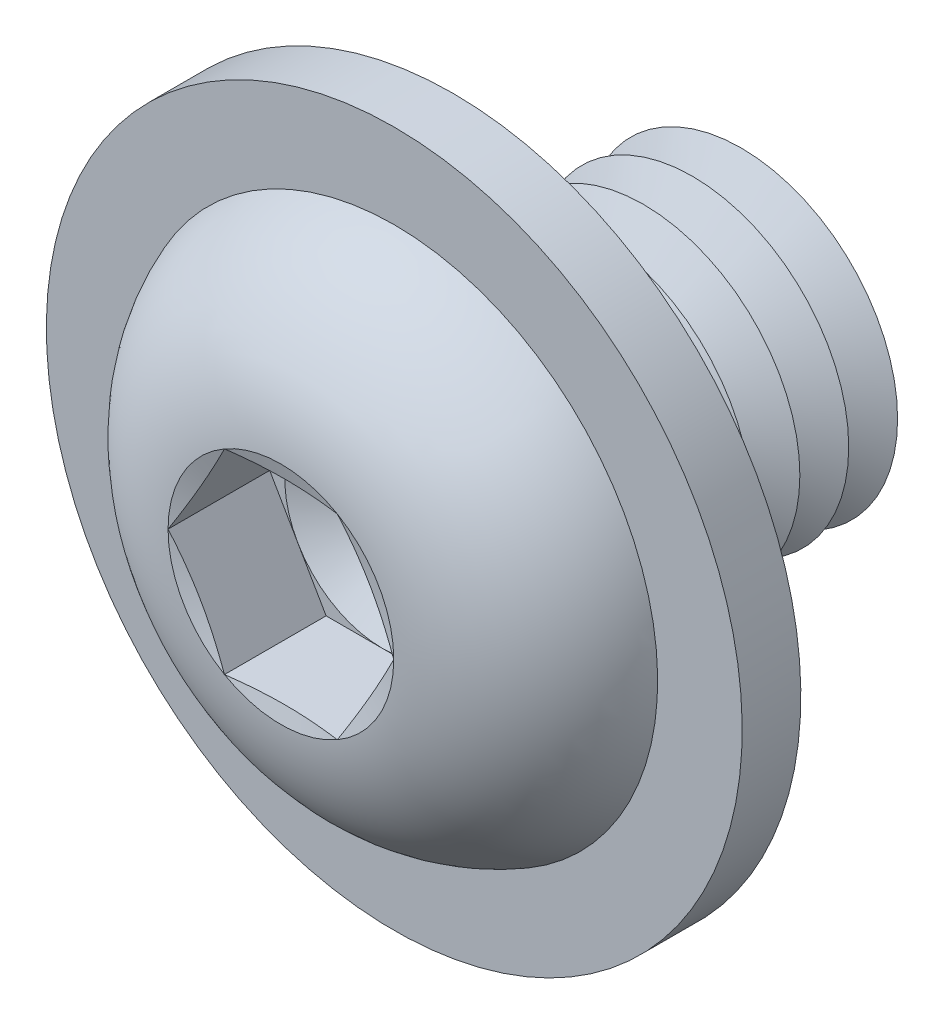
ISO-10303-21;
HEADER;
FILE_DESCRIPTION(('STEP AP214'),'2;1');
FILE_NAME('part.step','',(''),(''),'','','');
FILE_SCHEMA(('AUTOMOTIVE_DESIGN { 1 0 10303 214 1 1 1 1 }'));
ENDSEC;
DATA;
#1=APPLICATION_CONTEXT('core data for automotive mechanical design processes');
#2=APPLICATION_PROTOCOL_DEFINITION('international standard','automotive_design',2000,#1);
#3=PRODUCT_CONTEXT('',#1,'mechanical');
#4=PRODUCT('Part','Part','',(#3));
#5=PRODUCT_RELATED_PRODUCT_CATEGORY('part','',(#4));
#6=PRODUCT_DEFINITION_FORMATION('','',#4);
#7=PRODUCT_DEFINITION_CONTEXT('part definition',#1,'design');
#8=PRODUCT_DEFINITION('design','',#6,#7);
#9=PRODUCT_DEFINITION_SHAPE('','',#8);
#10=(LENGTH_UNIT() NAMED_UNIT(*) SI_UNIT(.MILLI.,.METRE.));
#11=(NAMED_UNIT(*) PLANE_ANGLE_UNIT() SI_UNIT($,.RADIAN.));
#12=(NAMED_UNIT(*) SI_UNIT($,.STERADIAN.) SOLID_ANGLE_UNIT());
#13=UNCERTAINTY_MEASURE_WITH_UNIT(LENGTH_MEASURE(1.E-05),#10,'distance_accuracy_value','');
#14=(GEOMETRIC_REPRESENTATION_CONTEXT(3) GLOBAL_UNCERTAINTY_ASSIGNED_CONTEXT((#13)) GLOBAL_UNIT_ASSIGNED_CONTEXT((#10,
#11,#12)) REPRESENTATION_CONTEXT('',''));
#15=CARTESIAN_POINT('',(0.,0.,0.));
#16=DIRECTION('',(0.,0.,1.));
#17=DIRECTION('',(1.,0.,0.));
#18=AXIS2_PLACEMENT_3D('',#15,#16,#17);
#19=CARTESIAN_POINT('',(0.,0.,-3.62500000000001));
#20=DIRECTION('',(0.,0.,1.));
#21=DIRECTION('',(0.,-1.,0.));
#22=AXIS2_PLACEMENT_3D('',#19,#20,#21);
#23=CONICAL_SURFACE('',#22,3.99999999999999,1.0471975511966);
#24=CARTESIAN_POINT('',(0.,0.,-4.25000000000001));
#25=DIRECTION('',(0.,0.,1.));
#26=DIRECTION('',(0.,-1.,0.));
#27=AXIS2_PLACEMENT_3D('',#24,#25,#26);
#28=CIRCLE('',#27,2.91746824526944);
#29=CARTESIAN_POINT('',(0.,-2.91746824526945,-4.25000000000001));
#30=VERTEX_POINT('',#29);
#31=EDGE_CURVE('E258',#30,#30,#28,.T.);
#32=ORIENTED_EDGE('',*,*,#31,.T.);
#33=EDGE_LOOP('',(#32));
#34=FACE_BOUND('',#33,.T.);
#35=CARTESIAN_POINT('',(0.,0.,-3.62500000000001));
#36=DIRECTION('',(0.,0.,1.));
#37=DIRECTION('',(0.,-1.,0.));
#38=AXIS2_PLACEMENT_3D('',#35,#36,#37);
#39=CIRCLE('',#38,3.99999999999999);
#40=CARTESIAN_POINT('',(0.,-4.,-3.62500000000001));
#41=VERTEX_POINT('',#40);
#42=EDGE_CURVE('E254',#41,#41,#39,.T.);
#43=ORIENTED_EDGE('',*,*,#42,.F.);
#44=EDGE_LOOP('',(#43));
#45=FACE_BOUND('',#44,.T.);
#46=ADVANCED_FACE('F39',(#34,#45),#23,.T.);
#47=CARTESIAN_POINT('',(0.,0.,-4.25000000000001));
#48=DIRECTION('',(0.,0.,-1.));
#49=DIRECTION('',(0.,1.,0.));
#50=AXIS2_PLACEMENT_3D('',#47,#48,#49);
#51=CONICAL_SURFACE('',#50,2.91746824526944,1.0471975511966);
#52=CARTESIAN_POINT('',(0.,0.,-4.87500000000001));
#53=DIRECTION('',(0.,0.,1.));
#54=DIRECTION('',(0.,-1.,0.));
#55=AXIS2_PLACEMENT_3D('',#52,#53,#54);
#56=CIRCLE('',#55,3.99999999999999);
#57=CARTESIAN_POINT('',(0.,-4.,-4.87500000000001));
#58=VERTEX_POINT('',#57);
#59=EDGE_CURVE('E262',#58,#58,#56,.T.);
#60=ORIENTED_EDGE('',*,*,#59,.T.);
#61=EDGE_LOOP('',(#60));
#62=FACE_BOUND('',#61,.T.);
#63=ORIENTED_EDGE('',*,*,#31,.F.);
#64=EDGE_LOOP('',(#63));
#65=FACE_BOUND('',#64,.T.);
#66=ADVANCED_FACE('F383',(#62,#65),#51,.T.);
#67=CARTESIAN_POINT('',(0.,3.99999999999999,-8.00000000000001));
#68=DIRECTION('',(0.,0.,-1.));
#69=DIRECTION('',(0.,1.,0.));
#70=AXIS2_PLACEMENT_3D('',#67,#68,#69);
#71=PLANE('',#70);
#72=CARTESIAN_POINT('',(0.,0.,-8.00000000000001));
#73=DIRECTION('',(0.,0.,1.));
#74=DIRECTION('',(0.,-1.,0.));
#75=AXIS2_PLACEMENT_3D('',#72,#73,#74);
#76=CIRCLE('',#75,2.91746824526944);
#77=CARTESIAN_POINT('',(0.,-2.91746824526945,-8.00000000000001));
#78=VERTEX_POINT('',#77);
#79=EDGE_CURVE('E282',#78,#78,#76,.T.);
#80=ORIENTED_EDGE('',*,*,#79,.F.);
#81=EDGE_LOOP('',(#80));
#82=FACE_BOUND('',#81,.T.);
#83=ADVANCED_FACE('F389',(#82),#71,.T.);
#84=CARTESIAN_POINT('',(0.,0.,-7.37500000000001));
#85=DIRECTION('',(0.,0.,1.));
#86=DIRECTION('',(0.,-1.,0.));
#87=AXIS2_PLACEMENT_3D('',#84,#85,#86);
#88=CONICAL_SURFACE('',#87,3.99999999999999,1.0471975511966);
#89=ORIENTED_EDGE('',*,*,#79,.T.);
#90=EDGE_LOOP('',(#89));
#91=FACE_BOUND('',#90,.T.);
#92=CARTESIAN_POINT('',(0.,0.,-7.37500000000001));
#93=DIRECTION('',(0.,0.,1.));
#94=DIRECTION('',(0.,-1.,0.));
#95=AXIS2_PLACEMENT_3D('',#92,#93,#94);
#96=CIRCLE('',#95,3.99999999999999);
#97=CARTESIAN_POINT('',(0.,-4.,-7.37500000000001));
#98=VERTEX_POINT('',#97);
#99=EDGE_CURVE('E278',#98,#98,#96,.T.);
#100=ORIENTED_EDGE('',*,*,#99,.F.);
#101=EDGE_LOOP('',(#100));
#102=FACE_BOUND('',#101,.T.);
#103=ADVANCED_FACE('F408',(#91,#102),#88,.T.);
#104=CARTESIAN_POINT('',(0.,0.,-6.75000000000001));
#105=DIRECTION('',(0.,0.,-1.));
#106=DIRECTION('',(0.,1.,0.));
#107=AXIS2_PLACEMENT_3D('',#104,#105,#106);
#108=CONICAL_SURFACE('',#107,2.91746824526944,1.0471975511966);
#109=ORIENTED_EDGE('',*,*,#99,.T.);
#110=EDGE_LOOP('',(#109));
#111=FACE_BOUND('',#110,.T.);
#112=CARTESIAN_POINT('',(0.,0.,-6.75000000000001));
#113=DIRECTION('',(0.,0.,1.));
#114=DIRECTION('',(0.,-1.,0.));
#115=AXIS2_PLACEMENT_3D('',#112,#113,#114);
#116=CIRCLE('',#115,2.91746824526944);
#117=CARTESIAN_POINT('',(0.,-2.91746824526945,-6.75000000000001));
#118=VERTEX_POINT('',#117);
#119=EDGE_CURVE('E274',#118,#118,#116,.T.);
#120=ORIENTED_EDGE('',*,*,#119,.F.);
#121=EDGE_LOOP('',(#120));
#122=FACE_BOUND('',#121,.T.);
#123=ADVANCED_FACE('F405',(#111,#122),#108,.T.);
#124=CARTESIAN_POINT('',(0.,0.,-6.12500000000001));
#125=DIRECTION('',(0.,0.,1.));
#126=DIRECTION('',(0.,-1.,0.));
#127=AXIS2_PLACEMENT_3D('',#124,#125,#126);
#128=CONICAL_SURFACE('',#127,3.99999999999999,1.0471975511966);
#129=ORIENTED_EDGE('',*,*,#119,.T.);
#130=EDGE_LOOP('',(#129));
#131=FACE_BOUND('',#130,.T.);
#132=CARTESIAN_POINT('',(0.,0.,-6.12500000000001));
#133=DIRECTION('',(0.,0.,1.));
#134=DIRECTION('',(0.,-1.,0.));
#135=AXIS2_PLACEMENT_3D('',#132,#133,#134);
#136=CIRCLE('',#135,3.99999999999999);
#137=CARTESIAN_POINT('',(0.,-4.,-6.12500000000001));
#138=VERTEX_POINT('',#137);
#139=EDGE_CURVE('E270',#138,#138,#136,.T.);
#140=ORIENTED_EDGE('',*,*,#139,.F.);
#141=EDGE_LOOP('',(#140));
#142=FACE_BOUND('',#141,.T.);
#143=ADVANCED_FACE('F399',(#131,#142),#128,.T.);
#144=CARTESIAN_POINT('',(0.,0.,-5.50000000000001));
#145=DIRECTION('',(0.,0.,-1.));
#146=DIRECTION('',(0.,1.,0.));
#147=AXIS2_PLACEMENT_3D('',#144,#145,#146);
#148=CONICAL_SURFACE('',#147,2.91746824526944,1.0471975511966);
#149=ORIENTED_EDGE('',*,*,#139,.T.);
#150=EDGE_LOOP('',(#149));
#151=FACE_BOUND('',#150,.T.);
#152=CARTESIAN_POINT('',(0.,0.,-5.50000000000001));
#153=DIRECTION('',(0.,0.,1.));
#154=DIRECTION('',(0.,-1.,0.));
#155=AXIS2_PLACEMENT_3D('',#152,#153,#154);
#156=CIRCLE('',#155,2.91746824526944);
#157=CARTESIAN_POINT('',(0.,-2.91746824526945,-5.50000000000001));
#158=VERTEX_POINT('',#157);
#159=EDGE_CURVE('E266',#158,#158,#156,.T.);
#160=ORIENTED_EDGE('',*,*,#159,.F.);
#161=EDGE_LOOP('',(#160));
#162=FACE_BOUND('',#161,.T.);
#163=ADVANCED_FACE('F395',(#151,#162),#148,.T.);
#164=CARTESIAN_POINT('',(0.,0.,-4.87500000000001));
#165=DIRECTION('',(0.,0.,1.));
#166=DIRECTION('',(0.,-1.,0.));
#167=AXIS2_PLACEMENT_3D('',#164,#165,#166);
#168=CONICAL_SURFACE('',#167,3.99999999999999,1.0471975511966);
#169=ORIENTED_EDGE('',*,*,#159,.T.);
#170=EDGE_LOOP('',(#169));
#171=FACE_BOUND('',#170,.T.);
#172=ORIENTED_EDGE('',*,*,#59,.F.);
#173=EDGE_LOOP('',(#172));
#174=FACE_BOUND('',#173,.T.);
#175=ADVANCED_FACE('F398',(#171,#174),#168,.T.);
#176=CARTESIAN_POINT('',(0.,0.,-2.37500000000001));
#177=DIRECTION('',(0.,0.,1.));
#178=DIRECTION('',(0.,-1.,0.));
#179=AXIS2_PLACEMENT_3D('',#176,#177,#178);
#180=CONICAL_SURFACE('',#179,3.99999999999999,1.0471975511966);
#181=CARTESIAN_POINT('',(0.,0.,-3.00000000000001));
#182=DIRECTION('',(0.,0.,1.));
#183=DIRECTION('',(0.,-1.,0.));
#184=AXIS2_PLACEMENT_3D('',#181,#182,#183);
#185=CIRCLE('',#184,2.91746824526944);
#186=CARTESIAN_POINT('',(0.,-2.91746824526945,-3.00000000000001));
#187=VERTEX_POINT('',#186);
#188=EDGE_CURVE('E250',#187,#187,#185,.T.);
#189=ORIENTED_EDGE('',*,*,#188,.T.);
#190=EDGE_LOOP('',(#189));
#191=FACE_BOUND('',#190,.T.);
#192=CARTESIAN_POINT('',(0.,0.,-2.37500000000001));
#193=DIRECTION('',(0.,0.,1.));
#194=DIRECTION('',(0.,-1.,0.));
#195=AXIS2_PLACEMENT_3D('',#192,#193,#194);
#196=CIRCLE('',#195,3.99999999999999);
#197=CARTESIAN_POINT('',(0.,-4.,-2.37500000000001));
#198=VERTEX_POINT('',#197);
#199=EDGE_CURVE('E242',#198,#198,#196,.T.);
#200=ORIENTED_EDGE('',*,*,#199,.F.);
#201=EDGE_LOOP('',(#200));
#202=FACE_BOUND('',#201,.T.);
#203=ADVANCED_FACE('F403',(#191,#202),#180,.T.);
#204=CARTESIAN_POINT('',(0.,0.,-3.00000000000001));
#205=DIRECTION('',(0.,0.,-1.));
#206=DIRECTION('',(0.,1.,0.));
#207=AXIS2_PLACEMENT_3D('',#204,#205,#206);
#208=CONICAL_SURFACE('',#207,2.91746824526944,1.0471975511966);
#209=ORIENTED_EDGE('',*,*,#42,.T.);
#210=EDGE_LOOP('',(#209));
#211=FACE_BOUND('',#210,.T.);
#212=ORIENTED_EDGE('',*,*,#188,.F.);
#213=EDGE_LOOP('',(#212));
#214=FACE_BOUND('',#213,.T.);
#215=ADVANCED_FACE('F454',(#211,#214),#208,.T.);
#216=CARTESIAN_POINT('',(0.,0.,-1.12500000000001));
#217=DIRECTION('',(0.,0.,1.));
#218=DIRECTION('',(0.,-1.,0.));
#219=AXIS2_PLACEMENT_3D('',#216,#217,#218);
#220=CONICAL_SURFACE('',#219,3.99999999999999,1.0471975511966);
#221=CARTESIAN_POINT('',(0.,0.,-1.75000000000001));
#222=DIRECTION('',(0.,0.,1.));
#223=DIRECTION('',(0.,-1.,0.));
#224=AXIS2_PLACEMENT_3D('',#221,#222,#223);
#225=CIRCLE('',#224,2.91746824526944);
#226=CARTESIAN_POINT('',(0.,-2.91746824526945,-1.75000000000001));
#227=VERTEX_POINT('',#226);
#228=EDGE_CURVE('E231',#227,#227,#225,.T.);
#229=ORIENTED_EDGE('',*,*,#228,.T.);
#230=EDGE_LOOP('',(#229));
#231=FACE_BOUND('',#230,.T.);
#232=CARTESIAN_POINT('',(0.,0.,-1.12500000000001));
#233=DIRECTION('',(0.,0.,1.));
#234=DIRECTION('',(0.,-1.,0.));
#235=AXIS2_PLACEMENT_3D('',#232,#233,#234);
#236=CIRCLE('',#235,3.99999999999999);
#237=CARTESIAN_POINT('',(0.,-4.,-1.12500000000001));
#238=VERTEX_POINT('',#237);
#239=EDGE_CURVE('E246',#238,#238,#236,.T.);
#240=ORIENTED_EDGE('',*,*,#239,.F.);
#241=EDGE_LOOP('',(#240));
#242=FACE_BOUND('',#241,.T.);
#243=ADVANCED_FACE('F460',(#231,#242),#220,.T.);
#244=CARTESIAN_POINT('',(0.,0.,-1.75000000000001));
#245=DIRECTION('',(0.,0.,-1.));
#246=DIRECTION('',(0.,1.,0.));
#247=AXIS2_PLACEMENT_3D('',#244,#245,#246);
#248=CONICAL_SURFACE('',#247,2.91746824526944,1.0471975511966);
#249=ORIENTED_EDGE('',*,*,#199,.T.);
#250=EDGE_LOOP('',(#249));
#251=FACE_BOUND('',#250,.T.);
#252=ORIENTED_EDGE('',*,*,#228,.F.);
#253=EDGE_LOOP('',(#252));
#254=FACE_BOUND('',#253,.T.);
#255=ADVANCED_FACE('F220',(#251,#254),#248,.T.);
#256=CARTESIAN_POINT('',(0.,3.99999999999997,0.));
#257=DIRECTION('',(0.,0.,-1.));
#258=DIRECTION('',(0.,1.,0.));
#259=AXIS2_PLACEMENT_3D('',#256,#257,#258);
#260=PLANE('',#259);
#261=CARTESIAN_POINT('',(0.,0.,0.));
#262=DIRECTION('',(0.,0.,-1.));
#263=DIRECTION('',(0.,1.,0.));
#264=AXIS2_PLACEMENT_3D('',#261,#262,#263);
#265=CIRCLE('',#264,4.62499999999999);
#266=CARTESIAN_POINT('',(0.,4.62499999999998,0.));
#267=VERTEX_POINT('',#266);
#268=EDGE_CURVE('E296',#267,#267,#265,.F.);
#269=ORIENTED_EDGE('',*,*,#268,.T.);
#270=EDGE_LOOP('',(#269));
#271=FACE_BOUND('',#270,.T.);
#272=CARTESIAN_POINT('',(0.,0.,0.));
#273=DIRECTION('',(0.,0.,-1.));
#274=DIRECTION('',(0.,1.,0.));
#275=AXIS2_PLACEMENT_3D('',#272,#273,#274);
#276=CIRCLE('',#275,8.9);
#277=CARTESIAN_POINT('',(0.,8.9,0.));
#278=VERTEX_POINT('',#277);
#279=EDGE_CURVE('E747',#278,#278,#276,.T.);
#280=ORIENTED_EDGE('',*,*,#279,.T.);
#281=EDGE_LOOP('',(#280));
#282=FACE_BOUND('',#281,.T.);
#283=ADVANCED_FACE('F472',(#271,#282),#260,.T.);
#284=CARTESIAN_POINT('',(0.,0.,-0.625000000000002));
#285=DIRECTION('',(0.,0.,-1.));
#286=DIRECTION('',(0.,1.,0.));
#287=AXIS2_PLACEMENT_3D('',#284,#285,#286);
#288=TOROIDAL_SURFACE('',#287,4.62499999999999,0.625);
#289=ORIENTED_EDGE('',*,*,#268,.F.);
#290=EDGE_LOOP('',(#289));
#291=FACE_BOUND('',#290,.T.);
#292=CARTESIAN_POINT('',(0.,0.,-0.625000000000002));
#293=DIRECTION('',(0.,0.,-1.));
#294=DIRECTION('',(0.,1.,0.));
#295=AXIS2_PLACEMENT_3D('',#292,#293,#294);
#296=CIRCLE('',#295,3.99999999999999);
#297=CARTESIAN_POINT('',(0.,3.99999999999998,-0.625));
#298=VERTEX_POINT('',#297);
#299=EDGE_CURVE('E291',#298,#298,#296,.T.);
#300=ORIENTED_EDGE('',*,*,#299,.F.);
#301=EDGE_LOOP('',(#300));
#302=FACE_BOUND('',#301,.T.);
#303=ADVANCED_FACE('F41',(#291,#302),#288,.F.);
#304=CARTESIAN_POINT('',(0.,0.,-8.00000000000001));
#305=DIRECTION('',(0.,0.,-1.));
#306=DIRECTION('',(0.,1.,0.));
#307=AXIS2_PLACEMENT_3D('',#304,#305,#306);
#308=CYLINDRICAL_SURFACE('',#307,3.99999999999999);
#309=ORIENTED_EDGE('',*,*,#299,.T.);
#310=EDGE_LOOP('',(#309));
#311=FACE_BOUND('',#310,.T.);
#312=ORIENTED_EDGE('',*,*,#239,.T.);
#313=EDGE_LOOP('',(#312));
#314=FACE_BOUND('',#313,.T.);
#315=ADVANCED_FACE('F484',(#311,#314),#308,.T.);
#316=CARTESIAN_POINT('',(0.,0.,1.5));
#317=DIRECTION('',(0.,0.,-1.));
#318=DIRECTION('',(0.,1.,0.));
#319=AXIS2_PLACEMENT_3D('',#316,#317,#318);
#320=CYLINDRICAL_SURFACE('',#319,8.9);
#321=CARTESIAN_POINT('',(0.,0.,1.5));
#322=DIRECTION('',(0.,0.,-1.));
#323=DIRECTION('',(0.,1.,0.));
#324=AXIS2_PLACEMENT_3D('',#321,#322,#323);
#325=CIRCLE('',#324,8.9);
#326=CARTESIAN_POINT('',(0.,8.9,1.5));
#327=VERTEX_POINT('',#326);
#328=EDGE_CURVE('E749',#327,#327,#325,.T.);
#329=ORIENTED_EDGE('',*,*,#328,.T.);
#330=EDGE_LOOP('',(#329));
#331=FACE_BOUND('',#330,.T.);
#332=ORIENTED_EDGE('',*,*,#279,.F.);
#333=EDGE_LOOP('',(#332));
#334=FACE_BOUND('',#333,.T.);
#335=ADVANCED_FACE('F490',(#331,#334),#320,.T.);
#336=CARTESIAN_POINT('',(0.,0.,1.5));
#337=DIRECTION('',(0.,0.,-1.));
#338=DIRECTION('',(0.,1.,0.));
#339=AXIS2_PLACEMENT_3D('',#336,#337,#338);
#340=PLANE('',#339);
#341=CARTESIAN_POINT('',(0.,0.,1.5));
#342=DIRECTION('',(0.,0.,-1.));
#343=DIRECTION('',(0.,1.,0.));
#344=AXIS2_PLACEMENT_3D('',#341,#342,#343);
#345=CIRCLE('',#344,6.73705889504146);
#346=CARTESIAN_POINT('',(0.,6.73705889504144,1.5));
#347=VERTEX_POINT('',#346);
#348=EDGE_CURVE('E43',#347,#347,#345,.F.);
#349=ORIENTED_EDGE('',*,*,#348,.F.);
#350=EDGE_LOOP('',(#349));
#351=FACE_BOUND('',#350,.T.);
#352=ORIENTED_EDGE('',*,*,#328,.F.);
#353=EDGE_LOOP('',(#352));
#354=FACE_BOUND('',#353,.T.);
#355=ADVANCED_FACE('F117',(#351,#354),#340,.F.);
#356=CARTESIAN_POINT('',(0.,0.,1.8));
#357=DIRECTION('',(0.,0.,1.));
#358=DIRECTION('',(1.,0.,0.));
#359=AXIS2_PLACEMENT_3D('',#356,#357,#358);
#360=CONICAL_SURFACE('',#359,2.49999883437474,1.0471975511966);
#361=CARTESIAN_POINT('',(0.,0.,0.356625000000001));
#362=VERTEX_POINT('',#361);
#363=VERTEX_LOOP('',#362);
#364=FACE_BOUND('',#363,.T.);
#365=CARTESIAN_POINT('',(0.,0.,1.8));
#366=DIRECTION('',(0.,0.,1.));
#367=DIRECTION('',(1.,0.,0.));
#368=AXIS2_PLACEMENT_3D('',#365,#366,#367);
#369=CIRCLE('',#368,2.49999883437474);
#370=CARTESIAN_POINT('',(2.16506250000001,1.24999941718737,1.8));
#371=VERTEX_POINT('',#370);
#372=CARTESIAN_POINT('',(0.,2.49999883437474,1.8));
#373=VERTEX_POINT('',#372);
#374=EDGE_CURVE('E120',#371,#373,#369,.T.);
#375=ORIENTED_EDGE('',*,*,#374,.T.);
#376=CARTESIAN_POINT('',(0.,0.,1.8));
#377=DIRECTION('',(0.,0.,1.));
#378=DIRECTION('',(1.,0.,0.));
#379=AXIS2_PLACEMENT_3D('',#376,#377,#378);
#380=CIRCLE('',#379,2.49999883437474);
#381=CARTESIAN_POINT('',(-2.16506250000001,1.24999941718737,1.8));
#382=VERTEX_POINT('',#381);
#383=EDGE_CURVE('E11',#373,#382,#380,.T.);
#384=ORIENTED_EDGE('',*,*,#383,.T.);
#385=CARTESIAN_POINT('',(-2.16506250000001,-1.24999941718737,1.8));
#386=VERTEX_POINT('',#385);
#387=EDGE_CURVE('E49',#382,#386,#380,.T.);
#388=ORIENTED_EDGE('',*,*,#387,.T.);
#389=CARTESIAN_POINT('',(0.,-2.49999883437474,1.8));
#390=VERTEX_POINT('',#389);
#391=EDGE_CURVE('E302',#386,#390,#380,.T.);
#392=ORIENTED_EDGE('',*,*,#391,.T.);
#393=CARTESIAN_POINT('',(2.16506250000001,-1.24999941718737,1.8));
#394=VERTEX_POINT('',#393);
#395=EDGE_CURVE('E57',#390,#394,#380,.T.);
#396=ORIENTED_EDGE('',*,*,#395,.T.);
#397=EDGE_CURVE('E50',#394,#371,#380,.T.);
#398=ORIENTED_EDGE('',*,*,#397,.T.);
#399=EDGE_LOOP('',(#375,#384,#388,#392,#396,#398));
#400=FACE_BOUND('',#399,.T.);
#401=ADVANCED_FACE('F114',(#364,#400),#360,.F.);
#402=CARTESIAN_POINT('',(0.,0.,1.8));
#403=DIRECTION('',(0.,0.,1.));
#404=DIRECTION('',(1.,0.,0.));
#405=AXIS2_PLACEMENT_3D('',#402,#403,#404);
#406=PLANE('',#405);
#407=ORIENTED_EDGE('',*,*,#383,.F.);
#408=DIRECTION('',(-1.,0.,0.));
#409=VECTOR('',#408,1.);
#410=CARTESIAN_POINT('',(1.44337500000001,2.49999883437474,1.8));
#411=LINE('',#410,#409);
#412=CARTESIAN_POINT('',(-1.44337500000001,2.49999883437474,1.8));
#413=VERTEX_POINT('',#412);
#414=EDGE_CURVE('E132',#373,#413,#411,.T.);
#415=ORIENTED_EDGE('',*,*,#414,.T.);
#416=DIRECTION('',(-0.5,-0.866025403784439,0.));
#417=VECTOR('',#416,1.);
#418=CARTESIAN_POINT('',(-1.44337500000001,2.49999883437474,1.8));
#419=LINE('',#418,#417);
#420=EDGE_CURVE('E135',#413,#382,#419,.T.);
#421=ORIENTED_EDGE('',*,*,#420,.T.);
#422=EDGE_LOOP('',(#407,#415,#421));
#423=FACE_BOUND('',#422,.T.);
#424=ADVANCED_FACE('F116',(#423),#406,.T.);
#425=ORIENTED_EDGE('',*,*,#387,.F.);
#426=CARTESIAN_POINT('',(-2.88675000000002,0.,1.8));
#427=VERTEX_POINT('',#426);
#428=EDGE_CURVE('E145',#382,#427,#419,.T.);
#429=ORIENTED_EDGE('',*,*,#428,.T.);
#430=DIRECTION('',(0.5,-0.866025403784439,0.));
#431=VECTOR('',#430,1.);
#432=CARTESIAN_POINT('',(-2.88675000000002,0.,1.8));
#433=LINE('',#432,#431);
#434=EDGE_CURVE('E154',#427,#386,#433,.T.);
#435=ORIENTED_EDGE('',*,*,#434,.T.);
#436=EDGE_LOOP('',(#425,#429,#435));
#437=FACE_BOUND('',#436,.T.);
#438=ADVANCED_FACE('F318',(#437),#406,.T.);
#439=ORIENTED_EDGE('',*,*,#391,.F.);
#440=CARTESIAN_POINT('',(-1.44337500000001,-2.49999883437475,1.8));
#441=VERTEX_POINT('',#440);
#442=EDGE_CURVE('E153',#386,#441,#433,.T.);
#443=ORIENTED_EDGE('',*,*,#442,.T.);
#444=DIRECTION('',(1.,0.,0.));
#445=VECTOR('',#444,1.);
#446=CARTESIAN_POINT('',(-1.44337500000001,-2.49999883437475,1.8));
#447=LINE('',#446,#445);
#448=EDGE_CURVE('E159',#441,#390,#447,.T.);
#449=ORIENTED_EDGE('',*,*,#448,.T.);
#450=EDGE_LOOP('',(#439,#443,#449));
#451=FACE_BOUND('',#450,.T.);
#452=ADVANCED_FACE('F312',(#451),#406,.T.);
#453=ORIENTED_EDGE('',*,*,#395,.F.);
#454=CARTESIAN_POINT('',(1.44337500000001,-2.49999883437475,1.8));
#455=VERTEX_POINT('',#454);
#456=EDGE_CURVE('E158',#390,#455,#447,.T.);
#457=ORIENTED_EDGE('',*,*,#456,.T.);
#458=DIRECTION('',(0.5,0.866025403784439,0.));
#459=VECTOR('',#458,1.);
#460=CARTESIAN_POINT('',(1.44337500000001,-2.49999883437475,1.8));
#461=LINE('',#460,#459);
#462=EDGE_CURVE('E164',#455,#394,#461,.T.);
#463=ORIENTED_EDGE('',*,*,#462,.T.);
#464=EDGE_LOOP('',(#453,#457,#463));
#465=FACE_BOUND('',#464,.T.);
#466=ADVANCED_FACE('F519',(#465),#406,.T.);
#467=ORIENTED_EDGE('',*,*,#397,.F.);
#468=CARTESIAN_POINT('',(2.88675000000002,0.,1.8));
#469=VERTEX_POINT('',#468);
#470=EDGE_CURVE('E163',#394,#469,#461,.T.);
#471=ORIENTED_EDGE('',*,*,#470,.T.);
#472=DIRECTION('',(-0.5,0.866025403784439,0.));
#473=VECTOR('',#472,1.);
#474=CARTESIAN_POINT('',(2.88675000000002,0.,1.8));
#475=LINE('',#474,#473);
#476=EDGE_CURVE('E141',#469,#371,#475,.T.);
#477=ORIENTED_EDGE('',*,*,#476,.T.);
#478=EDGE_LOOP('',(#467,#471,#477));
#479=FACE_BOUND('',#478,.T.);
#480=ADVANCED_FACE('F524',(#479),#406,.T.);
#481=ORIENTED_EDGE('',*,*,#374,.F.);
#482=CARTESIAN_POINT('',(1.44337500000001,2.49999883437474,1.8));
#483=VERTEX_POINT('',#482);
#484=EDGE_CURVE('E127',#371,#483,#475,.T.);
#485=ORIENTED_EDGE('',*,*,#484,.T.);
#486=EDGE_CURVE('E137',#483,#373,#411,.T.);
#487=ORIENTED_EDGE('',*,*,#486,.T.);
#488=EDGE_LOOP('',(#481,#485,#487));
#489=FACE_BOUND('',#488,.T.);
#490=ADVANCED_FACE('F143',(#489),#406,.T.);
#491=CARTESIAN_POINT('',(1.44337500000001,2.49999883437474,1.8));
#492=DIRECTION('',(0.,1.,0.));
#493=DIRECTION('',(-1.,0.,0.));
#494=AXIS2_PLACEMENT_3D('',#491,#492,#493);
#495=PLANE('',#494);
#496=CARTESIAN_POINT('',(4.35611719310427,2.49999883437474,4.97227902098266));
#497=CARTESIAN_POINT('',(4.25066509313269,2.49999883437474,4.94777440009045));
#498=CARTESIAN_POINT('',(4.14516541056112,2.49999883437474,4.92347459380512));
#499=CARTESIAN_POINT('',(3.93405094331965,2.49999883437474,4.87537247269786));
#500=CARTESIAN_POINT('',(3.8284361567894,2.49999883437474,4.85157016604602));
#501=CARTESIAN_POINT('',(3.51135349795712,2.49999883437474,4.78103338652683));
#502=CARTESIAN_POINT('',(3.29968815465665,2.49999883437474,4.73517861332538));
#503=CARTESIAN_POINT('',(2.8736552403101,2.49999883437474,4.64645582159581));
#504=CARTESIAN_POINT('',(2.65928093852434,2.49999883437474,4.60361983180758));
#505=CARTESIAN_POINT('',(2.22952626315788,2.49999883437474,4.52311285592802));
#506=CARTESIAN_POINT('',(2.01414580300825,2.49999883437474,4.48544232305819));
#507=CARTESIAN_POINT('',(1.58798319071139,2.49999883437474,4.41876559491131));
#508=CARTESIAN_POINT('',(1.37723418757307,2.49999883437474,4.38955265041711));
#509=CARTESIAN_POINT('',(0.954530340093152,2.49999883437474,4.34171384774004));
#510=CARTESIAN_POINT('',(0.742575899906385,2.49999883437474,4.32308463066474));
#511=CARTESIAN_POINT('',(0.424544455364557,2.49999883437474,4.3053914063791));
#512=CARTESIAN_POINT('',(0.318745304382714,2.49999883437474,4.30120018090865));
#513=CARTESIAN_POINT('',(0.107062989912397,2.49999883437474,4.29638997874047));
#514=CARTESIAN_POINT('',(0.00117982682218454,2.49999883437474,4.29577098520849));
#515=CARTESIAN_POINT('',(-0.210552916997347,2.49999883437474,4.29814378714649));
#516=CARTESIAN_POINT('',(-0.316402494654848,2.49999883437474,4.30113585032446));
#517=CARTESIAN_POINT('',(-0.527944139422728,2.49999883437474,4.31057322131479));
#518=CARTESIAN_POINT('',(-0.6336362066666,2.49999883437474,4.31701852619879));
#519=CARTESIAN_POINT('',(-0.890304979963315,2.49999883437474,4.33652018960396));
#520=CARTESIAN_POINT('',(-1.04115612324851,2.49999883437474,4.35122885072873));
#521=CARTESIAN_POINT('',(-1.34222474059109,2.49999883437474,4.38593609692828));
#522=CARTESIAN_POINT('',(-1.49244223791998,2.49999883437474,4.40593448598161));
#523=CARTESIAN_POINT('',(-1.79273634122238,2.49999883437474,4.45011321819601));
#524=CARTESIAN_POINT('',(-1.94281100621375,2.49999883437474,4.4743065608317));
#525=CARTESIAN_POINT('',(-2.24242097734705,2.49999883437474,4.52583552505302));
#526=CARTESIAN_POINT('',(-2.39195625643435,2.49999883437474,4.55317130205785));
#527=CARTESIAN_POINT('',(-2.69364402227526,2.49999883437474,4.61079781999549));
#528=CARTESIAN_POINT('',(-2.84578703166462,2.49999883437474,4.64113779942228));
#529=CARTESIAN_POINT('',(-3.1496901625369,2.49999883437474,4.70367638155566));
#530=CARTESIAN_POINT('',(-3.30145027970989,2.49999883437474,4.73587500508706));
#531=CARTESIAN_POINT('',(-3.60383766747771,2.49999883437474,4.80150275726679));
#532=CARTESIAN_POINT('',(-3.75446660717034,2.49999883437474,4.83492423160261));
#533=CARTESIAN_POINT('',(-4.05546753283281,2.49999883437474,4.90285814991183));
#534=CARTESIAN_POINT('',(-4.20583953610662,2.49999883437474,4.9373705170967));
#535=CARTESIAN_POINT('',(-4.35611719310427,2.49999883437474,4.97227902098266));
#536=B_SPLINE_CURVE_WITH_KNOTS('',3,(#496,#497,#498,#499,#500,#501,#502,#503,#504,#505,#506,
#507,#508,#509,#510,#511,#512,#513,#514,#515,#516,#517,#518,#519,#520,#521,#522,#523,#524,#525,
#526,#527,#528,#529,#530,#531,#532,#533,#534,#535),.UNSPECIFIED.,.F.,.F.,(4,2,2,2,2,2,2,2,2,2,2,
2,2,2,2,2,2,2,2,4),(0.,0.324785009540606,0.649575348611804,1.29928181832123,1.95507889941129,
2.61093348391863,3.24905289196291,3.88696967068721,4.20456300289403,4.52215483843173,
4.83977022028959,5.15738533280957,5.61196030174,6.06651842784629,6.52251118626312,
6.9785265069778,7.44392737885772,7.90933346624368,8.37220553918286,8.83504510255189),.UNSPECIFIED.);
#537=CARTESIAN_POINT('',(1.443375,2.49999883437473,4.4));
#538=VERTEX_POINT('',#537);
#539=CARTESIAN_POINT('',(-1.44337500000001,2.49999883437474,4.4));
#540=VERTEX_POINT('',#539);
#541=EDGE_CURVE('E172',#538,#540,#536,.T.);
#542=ORIENTED_EDGE('',*,*,#541,.T.);
#543=DIRECTION('',(0.,0.,1.));
#544=VECTOR('',#543,1.);
#545=CARTESIAN_POINT('',(-1.44337500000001,2.49999883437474,1.8));
#546=LINE('',#545,#544);
#547=EDGE_CURVE('E139',#413,#540,#546,.T.);
#548=ORIENTED_EDGE('',*,*,#547,.F.);
#549=ORIENTED_EDGE('',*,*,#414,.F.);
#550=ORIENTED_EDGE('',*,*,#486,.F.);
#551=DIRECTION('',(0.,0.,1.));
#552=VECTOR('',#551,1.);
#553=CARTESIAN_POINT('',(1.44337500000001,2.49999883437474,1.8));
#554=LINE('',#553,#552);
#555=EDGE_CURVE('E65',#483,#538,#554,.T.);
#556=ORIENTED_EDGE('',*,*,#555,.T.);
#557=EDGE_LOOP('',(#542,#548,#549,#550,#556));
#558=FACE_BOUND('',#557,.T.);
#559=ADVANCED_FACE('F136',(#558),#495,.F.);
#560=CARTESIAN_POINT('',(-1.44337500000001,2.49999883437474,1.8));
#561=DIRECTION('',(-0.866025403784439,0.5,0.));
#562=DIRECTION('',(-0.5,-0.866025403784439,0.));
#563=AXIS2_PLACEMENT_3D('',#560,#561,#562);
#564=PLANE('',#563);
#565=CARTESIAN_POINT('',(-1.44325952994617,2.50019883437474,4.40003094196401));
#566=CARTESIAN_POINT('',(-1.50320882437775,2.39636361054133,4.3839595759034));
#567=CARTESIAN_POINT('',(-1.56326682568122,2.2923401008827,4.36936933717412));
#568=CARTESIAN_POINT('',(-1.68359496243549,2.08392565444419,4.34373554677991));
#569=CARTESIAN_POINT('',(-1.74386517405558,1.97953458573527,4.33269343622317));
#570=CARTESIAN_POINT('',(-1.86425225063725,1.77101805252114,4.31480063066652));
#571=CARTESIAN_POINT('',(-1.9243683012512,1.66689399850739,4.3079285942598));
#572=CARTESIAN_POINT('',(-2.04467707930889,1.45851308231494,4.29871388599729));
#573=CARTESIAN_POINT('',(-2.10486978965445,1.35425624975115,4.29637033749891));
#574=CARTESIAN_POINT('',(-2.22525521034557,1.14574258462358,4.29637033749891));
#575=CARTESIAN_POINT('',(-2.28544792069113,1.0414857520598,4.29871388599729));
#576=CARTESIAN_POINT('',(-2.40575669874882,0.833104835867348,4.3079285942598));
#577=CARTESIAN_POINT('',(-2.46587274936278,0.728980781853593,4.31480063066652));
#578=CARTESIAN_POINT('',(-2.58625982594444,0.520464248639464,4.33269343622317));
#579=CARTESIAN_POINT('',(-2.64653003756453,0.416073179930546,4.3437355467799));
#580=CARTESIAN_POINT('',(-2.76685817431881,0.20765873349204,4.36936933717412));
#581=CARTESIAN_POINT('',(-2.82691617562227,0.103635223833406,4.3839595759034));
#582=CARTESIAN_POINT('',(-2.88686547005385,-0.000200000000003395,4.40003094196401));
#583=B_SPLINE_CURVE_WITH_KNOTS('',3,(#565,#566,#567,#568,#569,#570,#571,#572,#573,#574,#575,
#576,#577,#578,#579,#580,#581,#582),.UNSPECIFIED.,.F.,.F.,(4,2,2,2,2,2,2,2,4),(0.,
0.362931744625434,0.726010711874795,1.08721550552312,1.44835036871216,1.8094852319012,
2.17069002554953,2.53376899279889,2.89670073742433),.UNSPECIFIED.);
#584=CARTESIAN_POINT('',(-2.88675000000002,0.,4.4));
#585=VERTEX_POINT('',#584);
#586=EDGE_CURVE('E197',#540,#585,#583,.T.);
#587=ORIENTED_EDGE('',*,*,#586,.T.);
#588=DIRECTION('',(0.,0.,1.));
#589=VECTOR('',#588,1.);
#590=CARTESIAN_POINT('',(-2.88675000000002,0.,1.8));
#591=LINE('',#590,#589);
#592=EDGE_CURVE('E181',#427,#585,#591,.T.);
#593=ORIENTED_EDGE('',*,*,#592,.F.);
#594=ORIENTED_EDGE('',*,*,#428,.F.);
#595=ORIENTED_EDGE('',*,*,#420,.F.);
#596=ORIENTED_EDGE('',*,*,#547,.T.);
#597=EDGE_LOOP('',(#587,#593,#594,#595,#596));
#598=FACE_BOUND('',#597,.T.);
#599=ADVANCED_FACE('F211',(#598),#564,.F.);
#600=CARTESIAN_POINT('',(-2.88675000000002,0.,1.8));
#601=DIRECTION('',(-0.866025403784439,-0.5,0.));
#602=DIRECTION('',(0.5,-0.866025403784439,0.));
#603=AXIS2_PLACEMENT_3D('',#600,#601,#602);
#604=PLANE('',#603);
#605=CARTESIAN_POINT('',(-2.88686547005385,0.00019999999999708,4.40003094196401));
#606=CARTESIAN_POINT('',(-2.82691617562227,-0.103635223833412,4.3839595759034));
#607=CARTESIAN_POINT('',(-2.76685817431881,-0.207658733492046,4.36936933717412));
#608=CARTESIAN_POINT('',(-2.64653003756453,-0.416073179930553,4.3437355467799));
#609=CARTESIAN_POINT('',(-2.58625982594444,-0.52046424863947,4.33269343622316));
#610=CARTESIAN_POINT('',(-2.46587274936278,-0.728980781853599,4.31480063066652));
#611=CARTESIAN_POINT('',(-2.40575669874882,-0.833104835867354,4.3079285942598));
#612=CARTESIAN_POINT('',(-2.28544792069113,-1.0414857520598,4.29871388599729));
#613=CARTESIAN_POINT('',(-2.22525521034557,-1.14574258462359,4.29637033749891));
#614=CARTESIAN_POINT('',(-2.10486978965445,-1.35425624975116,4.29637033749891));
#615=CARTESIAN_POINT('',(-2.04467707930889,-1.45851308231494,4.29871388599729));
#616=CARTESIAN_POINT('',(-1.9243683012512,-1.66689399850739,4.3079285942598));
#617=CARTESIAN_POINT('',(-1.86425225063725,-1.77101805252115,4.31480063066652));
#618=CARTESIAN_POINT('',(-1.74386517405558,-1.97953458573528,4.33269343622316));
#619=CARTESIAN_POINT('',(-1.68359496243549,-2.0839256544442,4.3437355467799));
#620=CARTESIAN_POINT('',(-1.56326682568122,-2.2923401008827,4.36936933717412));
#621=CARTESIAN_POINT('',(-1.50320882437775,-2.39636361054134,4.3839595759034));
#622=CARTESIAN_POINT('',(-1.44325952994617,-2.50019883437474,4.400030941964));
#623=B_SPLINE_CURVE_WITH_KNOTS('',3,(#605,#606,#607,#608,#609,#610,#611,#612,#613,#614,#615,
#616,#617,#618,#619,#620,#621,#622),.UNSPECIFIED.,.F.,.F.,(4,2,2,2,2,2,2,2,4),(0.,
0.362931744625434,0.726010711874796,1.08721550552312,1.44835036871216,1.80948523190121,
2.17069002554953,2.53376899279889,2.89670073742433),.UNSPECIFIED.);
#624=CARTESIAN_POINT('',(-1.44337500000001,-2.49999883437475,4.4));
#625=VERTEX_POINT('',#624);
#626=EDGE_CURVE('E323',#585,#625,#623,.T.);
#627=ORIENTED_EDGE('',*,*,#626,.T.);
#628=DIRECTION('',(0.,0.,1.));
#629=VECTOR('',#628,1.);
#630=CARTESIAN_POINT('',(-1.44337500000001,-2.49999883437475,1.8));
#631=LINE('',#630,#629);
#632=EDGE_CURVE('E177',#441,#625,#631,.T.);
#633=ORIENTED_EDGE('',*,*,#632,.F.);
#634=ORIENTED_EDGE('',*,*,#442,.F.);
#635=ORIENTED_EDGE('',*,*,#434,.F.);
#636=ORIENTED_EDGE('',*,*,#592,.T.);
#637=EDGE_LOOP('',(#627,#633,#634,#635,#636));
#638=FACE_BOUND('',#637,.T.);
#639=ADVANCED_FACE('F317',(#638),#604,.F.);
#640=CARTESIAN_POINT('',(-1.44337500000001,-2.49999883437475,1.8));
#641=DIRECTION('',(0.,-1.,0.));
#642=DIRECTION('',(0.,0.,-1.));
#643=AXIS2_PLACEMENT_3D('',#640,#641,#642);
#644=PLANE('',#643);
#645=CARTESIAN_POINT('',(-4.35611719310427,-2.49999883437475,4.97227902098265));
#646=CARTESIAN_POINT('',(-4.25066509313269,-2.49999883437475,4.94777440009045));
#647=CARTESIAN_POINT('',(-4.14516541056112,-2.49999883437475,4.92347459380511));
#648=CARTESIAN_POINT('',(-3.93405094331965,-2.49999883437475,4.87537247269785));
#649=CARTESIAN_POINT('',(-3.8284361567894,-2.49999883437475,4.85157016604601));
#650=CARTESIAN_POINT('',(-3.51135349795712,-2.49999883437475,4.78103338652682));
#651=CARTESIAN_POINT('',(-3.29968815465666,-2.49999883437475,4.73517861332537));
#652=CARTESIAN_POINT('',(-2.8736552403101,-2.49999883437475,4.6464558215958));
#653=CARTESIAN_POINT('',(-2.65928093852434,-2.49999883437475,4.60361983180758));
#654=CARTESIAN_POINT('',(-2.22952626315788,-2.49999883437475,4.52311285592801));
#655=CARTESIAN_POINT('',(-2.01414580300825,-2.49999883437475,4.48544232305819));
#656=CARTESIAN_POINT('',(-1.58798319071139,-2.49999883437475,4.4187655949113));
#657=CARTESIAN_POINT('',(-1.37723418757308,-2.49999883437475,4.3895526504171));
#658=CARTESIAN_POINT('',(-0.954530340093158,-2.49999883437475,4.34171384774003));
#659=CARTESIAN_POINT('',(-0.742575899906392,-2.49999883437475,4.32308463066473));
#660=CARTESIAN_POINT('',(-0.424544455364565,-2.49999883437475,4.30539140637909));
#661=CARTESIAN_POINT('',(-0.318745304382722,-2.49999883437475,4.30120018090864));
#662=CARTESIAN_POINT('',(-0.107062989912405,-2.49999883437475,4.29638997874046));
#663=CARTESIAN_POINT('',(-0.00117982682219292,-2.49999883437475,4.29577098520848));
#664=CARTESIAN_POINT('',(0.210552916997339,-2.49999883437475,4.29814378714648));
#665=CARTESIAN_POINT('',(0.31640249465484,-2.49999883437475,4.30113585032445));
#666=CARTESIAN_POINT('',(0.527944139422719,-2.49999883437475,4.31057322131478));
#667=CARTESIAN_POINT('',(0.63363620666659,-2.49999883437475,4.31701852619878));
#668=CARTESIAN_POINT('',(0.890304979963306,-2.49999883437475,4.33652018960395));
#669=CARTESIAN_POINT('',(1.0411561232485,-2.49999883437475,4.35122885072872));
#670=CARTESIAN_POINT('',(1.34222474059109,-2.49999883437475,4.38593609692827));
#671=CARTESIAN_POINT('',(1.49244223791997,-2.49999883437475,4.40593448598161));
#672=CARTESIAN_POINT('',(1.79273634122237,-2.49999883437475,4.450113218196));
#673=CARTESIAN_POINT('',(1.94281100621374,-2.49999883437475,4.47430656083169));
#674=CARTESIAN_POINT('',(2.24242097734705,-2.49999883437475,4.52583552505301));
#675=CARTESIAN_POINT('',(2.39195625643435,-2.49999883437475,4.55317130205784));
#676=CARTESIAN_POINT('',(2.69364402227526,-2.49999883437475,4.61079781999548));
#677=CARTESIAN_POINT('',(2.84578703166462,-2.49999883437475,4.64113779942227));
#678=CARTESIAN_POINT('',(3.1496901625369,-2.49999883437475,4.70367638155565));
#679=CARTESIAN_POINT('',(3.30145027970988,-2.49999883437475,4.73587500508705));
#680=CARTESIAN_POINT('',(3.60383766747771,-2.49999883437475,4.80150275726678));
#681=CARTESIAN_POINT('',(3.75446660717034,-2.49999883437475,4.83492423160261));
#682=CARTESIAN_POINT('',(4.05546753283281,-2.49999883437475,4.90285814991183));
#683=CARTESIAN_POINT('',(4.20583953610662,-2.49999883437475,4.93737051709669));
#684=CARTESIAN_POINT('',(4.35611719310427,-2.49999883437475,4.97227902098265));
#685=B_SPLINE_CURVE_WITH_KNOTS('',3,(#645,#646,#647,#648,#649,#650,#651,#652,#653,#654,#655,
#656,#657,#658,#659,#660,#661,#662,#663,#664,#665,#666,#667,#668,#669,#670,#671,#672,#673,#674,
#675,#676,#677,#678,#679,#680,#681,#682,#683,#684),.UNSPECIFIED.,.F.,.F.,(4,2,2,2,2,2,2,2,2,2,2,
2,2,2,2,2,2,2,2,4),(0.,0.324785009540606,0.649575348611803,1.29928181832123,1.95507889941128,
2.61093348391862,3.2490528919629,3.88696967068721,4.20456300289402,4.52215483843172,
4.83977022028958,5.15738533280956,5.61196030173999,6.06651842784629,6.52251118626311,
6.9785265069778,7.44392737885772,7.90933346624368,8.37220553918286,8.83504510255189),.UNSPECIFIED.);
#686=CARTESIAN_POINT('',(1.44337500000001,-2.49999883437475,4.4));
#687=VERTEX_POINT('',#686);
#688=EDGE_CURVE('E332',#625,#687,#685,.T.);
#689=ORIENTED_EDGE('',*,*,#688,.T.);
#690=DIRECTION('',(0.,0.,1.));
#691=VECTOR('',#690,1.);
#692=CARTESIAN_POINT('',(1.44337500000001,-2.49999883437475,1.8));
#693=LINE('',#692,#691);
#694=EDGE_CURVE('E173',#455,#687,#693,.T.);
#695=ORIENTED_EDGE('',*,*,#694,.F.);
#696=ORIENTED_EDGE('',*,*,#456,.F.);
#697=ORIENTED_EDGE('',*,*,#448,.F.);
#698=ORIENTED_EDGE('',*,*,#632,.T.);
#699=EDGE_LOOP('',(#689,#695,#696,#697,#698));
#700=FACE_BOUND('',#699,.T.);
#701=ADVANCED_FACE('F372',(#700),#644,.F.);
#702=CARTESIAN_POINT('',(1.44337500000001,-2.49999883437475,1.8));
#703=DIRECTION('',(0.866025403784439,-0.5,0.));
#704=DIRECTION('',(0.5,0.866025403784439,0.));
#705=AXIS2_PLACEMENT_3D('',#702,#703,#704);
#706=PLANE('',#705);
#707=CARTESIAN_POINT('',(1.44325952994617,-2.50019883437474,4.400030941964));
#708=CARTESIAN_POINT('',(1.50320882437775,-2.39636361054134,4.3839595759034));
#709=CARTESIAN_POINT('',(1.56326682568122,-2.2923401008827,4.36936933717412));
#710=CARTESIAN_POINT('',(1.68359496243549,-2.0839256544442,4.3437355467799));
#711=CARTESIAN_POINT('',(1.74386517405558,-1.97953458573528,4.33269343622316));
#712=CARTESIAN_POINT('',(1.86425225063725,-1.77101805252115,4.31480063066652));
#713=CARTESIAN_POINT('',(1.9243683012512,-1.66689399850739,4.3079285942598));
#714=CARTESIAN_POINT('',(2.04467707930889,-1.45851308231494,4.29871388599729));
#715=CARTESIAN_POINT('',(2.10486978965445,-1.35425624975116,4.29637033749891));
#716=CARTESIAN_POINT('',(2.22525521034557,-1.14574258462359,4.29637033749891));
#717=CARTESIAN_POINT('',(2.28544792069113,-1.0414857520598,4.29871388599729));
#718=CARTESIAN_POINT('',(2.40575669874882,-0.833104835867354,4.3079285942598));
#719=CARTESIAN_POINT('',(2.46587274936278,-0.728980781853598,4.31480063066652));
#720=CARTESIAN_POINT('',(2.58625982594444,-0.52046424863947,4.33269343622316));
#721=CARTESIAN_POINT('',(2.64653003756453,-0.416073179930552,4.3437355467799));
#722=CARTESIAN_POINT('',(2.76685817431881,-0.207658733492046,4.36936933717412));
#723=CARTESIAN_POINT('',(2.82691617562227,-0.103635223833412,4.3839595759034));
#724=CARTESIAN_POINT('',(2.88686547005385,0.000199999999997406,4.40003094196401));
#725=B_SPLINE_CURVE_WITH_KNOTS('',3,(#707,#708,#709,#710,#711,#712,#713,#714,#715,#716,#717,
#718,#719,#720,#721,#722,#723,#724),.UNSPECIFIED.,.F.,.F.,(4,2,2,2,2,2,2,2,4),(0.,
0.362931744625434,0.726010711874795,1.08721550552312,1.44835036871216,1.80948523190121,
2.17069002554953,2.53376899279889,2.89670073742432),.UNSPECIFIED.);
#726=CARTESIAN_POINT('',(2.88675000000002,0.,4.4));
#727=VERTEX_POINT('',#726);
#728=EDGE_CURVE('E232',#687,#727,#725,.T.);
#729=ORIENTED_EDGE('',*,*,#728,.T.);
#730=DIRECTION('',(0.,0.,1.));
#731=VECTOR('',#730,1.);
#732=CARTESIAN_POINT('',(2.88675000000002,0.,1.8));
#733=LINE('',#732,#731);
#734=EDGE_CURVE('E168',#469,#727,#733,.T.);
#735=ORIENTED_EDGE('',*,*,#734,.F.);
#736=ORIENTED_EDGE('',*,*,#470,.F.);
#737=ORIENTED_EDGE('',*,*,#462,.F.);
#738=ORIENTED_EDGE('',*,*,#694,.T.);
#739=EDGE_LOOP('',(#729,#735,#736,#737,#738));
#740=FACE_BOUND('',#739,.T.);
#741=ADVANCED_FACE('F218',(#740),#706,.F.);
#742=CARTESIAN_POINT('',(2.88675000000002,0.,1.8));
#743=DIRECTION('',(0.866025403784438,0.5,0.));
#744=DIRECTION('',(-0.5,0.866025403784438,0.));
#745=AXIS2_PLACEMENT_3D('',#742,#743,#744);
#746=PLANE('',#745);
#747=CARTESIAN_POINT('',(2.88686547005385,-0.00020000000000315,4.40003094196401));
#748=CARTESIAN_POINT('',(2.82691617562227,0.103635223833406,4.3839595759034));
#749=CARTESIAN_POINT('',(2.76685817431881,0.20765873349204,4.36936933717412));
#750=CARTESIAN_POINT('',(2.64653003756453,0.416073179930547,4.3437355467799));
#751=CARTESIAN_POINT('',(2.58625982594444,0.520464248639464,4.33269343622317));
#752=CARTESIAN_POINT('',(2.46587274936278,0.728980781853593,4.31480063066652));
#753=CARTESIAN_POINT('',(2.40575669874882,0.833104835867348,4.3079285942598));
#754=CARTESIAN_POINT('',(2.28544792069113,1.0414857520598,4.29871388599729));
#755=CARTESIAN_POINT('',(2.22525521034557,1.14574258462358,4.29637033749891));
#756=CARTESIAN_POINT('',(2.10486978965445,1.35425624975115,4.29637033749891));
#757=CARTESIAN_POINT('',(2.04467707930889,1.45851308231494,4.29871388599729));
#758=CARTESIAN_POINT('',(1.9243683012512,1.66689399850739,4.3079285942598));
#759=CARTESIAN_POINT('',(1.86425225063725,1.77101805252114,4.31480063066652));
#760=CARTESIAN_POINT('',(1.74386517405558,1.97953458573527,4.33269343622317));
#761=CARTESIAN_POINT('',(1.68359496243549,2.08392565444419,4.3437355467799));
#762=CARTESIAN_POINT('',(1.56326682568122,2.29234010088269,4.36936933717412));
#763=CARTESIAN_POINT('',(1.50320882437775,2.39636361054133,4.3839595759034));
#764=CARTESIAN_POINT('',(1.44325952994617,2.50019883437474,4.40003094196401));
#765=B_SPLINE_CURVE_WITH_KNOTS('',3,(#747,#748,#749,#750,#751,#752,#753,#754,#755,#756,#757,
#758,#759,#760,#761,#762,#763,#764),.UNSPECIFIED.,.F.,.F.,(4,2,2,2,2,2,2,2,4),(0.,
0.362931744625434,0.726010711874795,1.08721550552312,1.44835036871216,1.8094852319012,
2.17069002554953,2.53376899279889,2.89670073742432),.UNSPECIFIED.);
#766=EDGE_CURVE('E223',#727,#538,#765,.T.);
#767=ORIENTED_EDGE('',*,*,#766,.T.);
#768=ORIENTED_EDGE('',*,*,#555,.F.);
#769=ORIENTED_EDGE('',*,*,#484,.F.);
#770=ORIENTED_EDGE('',*,*,#476,.F.);
#771=ORIENTED_EDGE('',*,*,#734,.T.);
#772=EDGE_LOOP('',(#767,#768,#769,#770,#771));
#773=FACE_BOUND('',#772,.T.);
#774=ADVANCED_FACE('F214',(#773),#746,.F.);
#775=CARTESIAN_POINT('',(0.,0.,4.4));
#776=DIRECTION('',(0.,0.,1.));
#777=DIRECTION('',(0.,-1.,0.));
#778=AXIS2_PLACEMENT_3D('',#775,#776,#777);
#779=CONICAL_SURFACE('',#778,2.88675000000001,1.30899693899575);
#780=ORIENTED_EDGE('',*,*,#541,.F.);
#781=CARTESIAN_POINT('',(0.,0.,4.4));
#782=DIRECTION('',(0.,0.,-1.));
#783=DIRECTION('',(0.,1.,0.));
#784=AXIS2_PLACEMENT_3D('',#781,#782,#783);
#785=CIRCLE('',#784,2.88675000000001);
#786=EDGE_CURVE('E286',#540,#538,#785,.T.);
#787=ORIENTED_EDGE('',*,*,#786,.F.);
#788=EDGE_LOOP('',(#780,#787));
#789=FACE_BOUND('',#788,.T.);
#790=ADVANCED_FACE('F204',(#789),#779,.F.);
#791=ORIENTED_EDGE('',*,*,#586,.F.);
#792=EDGE_CURVE('E335',#585,#540,#785,.T.);
#793=ORIENTED_EDGE('',*,*,#792,.F.);
#794=EDGE_LOOP('',(#791,#793));
#795=FACE_BOUND('',#794,.T.);
#796=ADVANCED_FACE('F336',(#795),#779,.F.);
#797=ORIENTED_EDGE('',*,*,#626,.F.);
#798=EDGE_CURVE('E329',#625,#585,#785,.T.);
#799=ORIENTED_EDGE('',*,*,#798,.F.);
#800=EDGE_LOOP('',(#797,#799));
#801=FACE_BOUND('',#800,.T.);
#802=ADVANCED_FACE('F327',(#801),#779,.F.);
#803=ORIENTED_EDGE('',*,*,#688,.F.);
#804=EDGE_CURVE('E344',#687,#625,#785,.T.);
#805=ORIENTED_EDGE('',*,*,#804,.F.);
#806=EDGE_LOOP('',(#803,#805));
#807=FACE_BOUND('',#806,.T.);
#808=ADVANCED_FACE('F359',(#807),#779,.F.);
#809=ORIENTED_EDGE('',*,*,#728,.F.);
#810=EDGE_CURVE('E292',#727,#687,#785,.T.);
#811=ORIENTED_EDGE('',*,*,#810,.F.);
#812=EDGE_LOOP('',(#809,#811));
#813=FACE_BOUND('',#812,.T.);
#814=ADVANCED_FACE('F354',(#813),#779,.F.);
#815=ORIENTED_EDGE('',*,*,#766,.F.);
#816=EDGE_CURVE('E287',#538,#727,#785,.T.);
#817=ORIENTED_EDGE('',*,*,#816,.F.);
#818=EDGE_LOOP('',(#815,#817));
#819=FACE_BOUND('',#818,.T.);
#820=ADVANCED_FACE('F567',(#819),#779,.F.);
#821=CARTESIAN_POINT('',(0.,0.,0.));
#822=DIRECTION('',(0.,0.,-1.));
#823=DIRECTION('',(0.,1.,0.));
#824=AXIS2_PLACEMENT_3D('',#821,#822,#823);
#825=DEGENERATE_TOROIDAL_SURFACE('',#824,2.59000479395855,4.40999520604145,.T.);
#826=ORIENTED_EDGE('',*,*,#816,.T.);
#827=ORIENTED_EDGE('',*,*,#810,.T.);
#828=ORIENTED_EDGE('',*,*,#804,.T.);
#829=ORIENTED_EDGE('',*,*,#798,.T.);
#830=ORIENTED_EDGE('',*,*,#792,.T.);
#831=ORIENTED_EDGE('',*,*,#786,.T.);
#832=EDGE_LOOP('',(#826,#827,#828,#829,#830,#831));
#833=FACE_BOUND('',#832,.T.);
#834=ORIENTED_EDGE('',*,*,#348,.T.);
#835=EDGE_LOOP('',(#834));
#836=FACE_BOUND('',#835,.T.);
#837=ADVANCED_FACE('F340',(#833,#836),#825,.T.);
#838=CLOSED_SHELL('',(#46,#66,#83,#103,#123,#143,#163,#175,#203,#215,#243,#255,#283,#303,#315,
#335,#355,#401,#424,#438,#452,#466,#480,#490,#559,#599,#639,#701,#741,#774,#790,#796,#802,#808,
#814,#820,#837));
#839=MANIFOLD_SOLID_BREP('B2',#838);
#840=ADVANCED_BREP_SHAPE_REPRESENTATION('',(#18,#839),#14);
#841=SHAPE_DEFINITION_REPRESENTATION(#9,#840);
ENDSEC;
END-ISO-10303-21;
